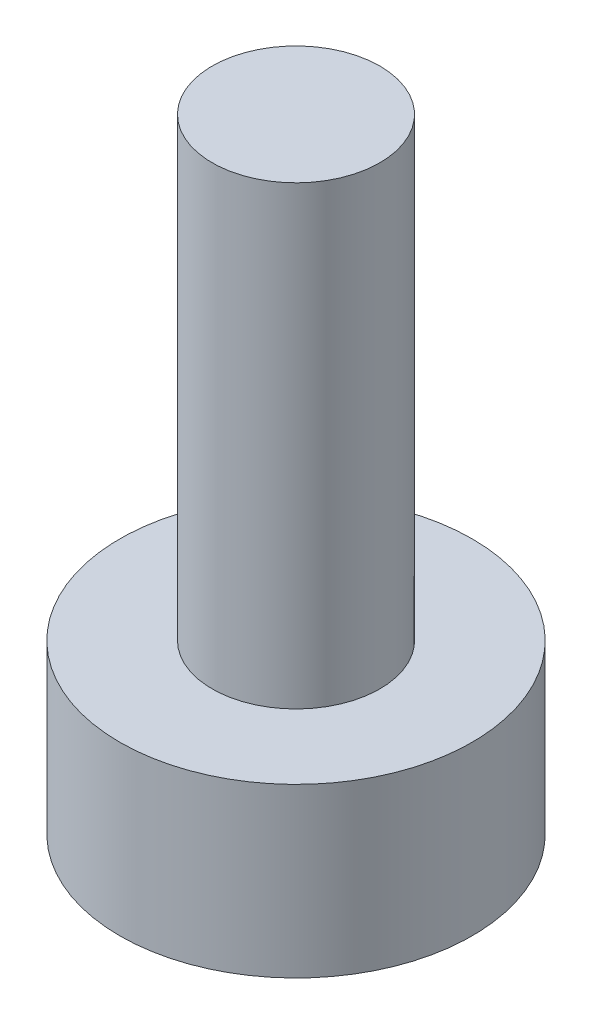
ISO-10303-21;
HEADER;
FILE_DESCRIPTION(('STEP AP214'),'2;1');
FILE_NAME('part.step','',(''),(''),'','','');
FILE_SCHEMA(('AUTOMOTIVE_DESIGN { 1 0 10303 214 1 1 1 1 }'));
ENDSEC;
DATA;
#1=APPLICATION_CONTEXT('core data for automotive mechanical design processes');
#2=APPLICATION_PROTOCOL_DEFINITION('international standard','automotive_design',2000,#1);
#3=PRODUCT_CONTEXT('',#1,'mechanical');
#4=PRODUCT('Part','Part','',(#3));
#5=PRODUCT_RELATED_PRODUCT_CATEGORY('part','',(#4));
#6=PRODUCT_DEFINITION_FORMATION('','',#4);
#7=PRODUCT_DEFINITION_CONTEXT('part definition',#1,'design');
#8=PRODUCT_DEFINITION('design','',#6,#7);
#9=PRODUCT_DEFINITION_SHAPE('','',#8);
#10=(LENGTH_UNIT() NAMED_UNIT(*) SI_UNIT(.MILLI.,.METRE.));
#11=(NAMED_UNIT(*) PLANE_ANGLE_UNIT() SI_UNIT($,.RADIAN.));
#12=(NAMED_UNIT(*) SI_UNIT($,.STERADIAN.) SOLID_ANGLE_UNIT());
#13=UNCERTAINTY_MEASURE_WITH_UNIT(LENGTH_MEASURE(1.E-05),#10,'distance_accuracy_value','');
#14=(GEOMETRIC_REPRESENTATION_CONTEXT(3) GLOBAL_UNCERTAINTY_ASSIGNED_CONTEXT((#13)) GLOBAL_UNIT_ASSIGNED_CONTEXT((#10,
#11,#12)) REPRESENTATION_CONTEXT('',''));
#15=CARTESIAN_POINT('',(0.,0.,0.));
#16=DIRECTION('',(0.,0.,1.));
#17=DIRECTION('',(1.,0.,0.));
#18=AXIS2_PLACEMENT_3D('',#15,#16,#17);
#19=CARTESIAN_POINT('',(0.,3.5052,0.));
#20=DIRECTION('',(0.,1.,0.));
#21=DIRECTION('',(0.,0.,1.));
#22=AXIS2_PLACEMENT_3D('',#19,#20,#21);
#23=PLANE('',#22);
#24=CARTESIAN_POINT('',(0.,3.5052,0.));
#25=DIRECTION('',(0.,1.,0.));
#26=DIRECTION('',(0.,0.,1.));
#27=AXIS2_PLACEMENT_3D('',#24,#25,#26);
#28=CIRCLE('',#27,3.683);
#29=CARTESIAN_POINT('',(0.,3.5052,3.683));
#30=VERTEX_POINT('',#29);
#31=EDGE_CURVE('E10',#30,#30,#28,.T.);
#32=ORIENTED_EDGE('',*,*,#31,.T.);
#33=EDGE_LOOP('',(#32));
#34=FACE_BOUND('',#33,.T.);
#35=CARTESIAN_POINT('',(0.,3.5052,0.));
#36=DIRECTION('',(0.,1.,0.));
#37=DIRECTION('',(0.,0.,1.));
#38=AXIS2_PLACEMENT_3D('',#35,#36,#37);
#39=CIRCLE('',#38,1.7526);
#40=CARTESIAN_POINT('',(0.,3.5052,-1.7526));
#41=VERTEX_POINT('',#40);
#42=EDGE_CURVE('E43',#41,#41,#39,.T.);
#43=ORIENTED_EDGE('',*,*,#42,.F.);
#44=EDGE_LOOP('',(#43));
#45=FACE_BOUND('',#44,.T.);
#46=ADVANCED_FACE('F28',(#34,#45),#23,.T.);
#47=CARTESIAN_POINT('',(0.,3.5052,0.));
#48=DIRECTION('',(0.,-1.,0.));
#49=DIRECTION('',(0.,0.,-1.));
#50=AXIS2_PLACEMENT_3D('',#47,#48,#49);
#51=CYLINDRICAL_SURFACE('',#50,3.683);
#52=ORIENTED_EDGE('',*,*,#31,.F.);
#53=EDGE_LOOP('',(#52));
#54=FACE_BOUND('',#53,.T.);
#55=CARTESIAN_POINT('',(0.,0.,0.));
#56=DIRECTION('',(0.,1.,0.));
#57=DIRECTION('',(0.,0.,1.));
#58=AXIS2_PLACEMENT_3D('',#55,#56,#57);
#59=CIRCLE('',#58,3.683);
#60=CARTESIAN_POINT('',(0.,0.,3.683));
#61=VERTEX_POINT('',#60);
#62=EDGE_CURVE('E35',#61,#61,#59,.T.);
#63=ORIENTED_EDGE('',*,*,#62,.T.);
#64=EDGE_LOOP('',(#63));
#65=FACE_BOUND('',#64,.T.);
#66=ADVANCED_FACE('F30',(#54,#65),#51,.T.);
#67=CARTESIAN_POINT('',(0.,0.,0.));
#68=DIRECTION('',(0.,1.,0.));
#69=DIRECTION('',(0.,0.,1.));
#70=AXIS2_PLACEMENT_3D('',#67,#68,#69);
#71=PLANE('',#70);
#72=ORIENTED_EDGE('',*,*,#62,.F.);
#73=EDGE_LOOP('',(#72));
#74=FACE_BOUND('',#73,.T.);
#75=ADVANCED_FACE('F55',(#74),#71,.F.);
#76=CARTESIAN_POINT('',(0.,13.0302,0.));
#77=DIRECTION('',(0.,-1.,0.));
#78=DIRECTION('',(0.,0.,-1.));
#79=AXIS2_PLACEMENT_3D('',#76,#77,#78);
#80=CYLINDRICAL_SURFACE('',#79,1.7526);
#81=CARTESIAN_POINT('',(0.,13.0302,0.));
#82=DIRECTION('',(0.,1.,0.));
#83=DIRECTION('',(0.,0.,1.));
#84=AXIS2_PLACEMENT_3D('',#81,#82,#83);
#85=CIRCLE('',#84,1.7526);
#86=CARTESIAN_POINT('',(0.,13.0302,-1.7526));
#87=VERTEX_POINT('',#86);
#88=EDGE_CURVE('E39',#87,#87,#85,.T.);
#89=CARTESIAN_POINT('',(0.,13.0302,-1.7526));
#90=CARTESIAN_POINT('',(0.,12.93098125,-1.7526));
#91=CARTESIAN_POINT('',(0.,12.8317625,-1.7526));
#92=CARTESIAN_POINT('',(0.,12.633325,-1.7526));
#93=CARTESIAN_POINT('',(0.,12.53410625,-1.7526));
#94=CARTESIAN_POINT('',(0.,12.33566875,-1.7526));
#95=CARTESIAN_POINT('',(0.,12.23645,-1.7526));
#96=CARTESIAN_POINT('',(0.,12.0380125,-1.7526));
#97=CARTESIAN_POINT('',(0.,11.93879375,-1.7526));
#98=CARTESIAN_POINT('',(0.,11.74035625,-1.7526));
#99=CARTESIAN_POINT('',(0.,11.6411375,-1.7526));
#100=CARTESIAN_POINT('',(0.,11.4427,-1.7526));
#101=CARTESIAN_POINT('',(0.,11.34348125,-1.7526));
#102=CARTESIAN_POINT('',(0.,11.14504375,-1.7526));
#103=CARTESIAN_POINT('',(0.,11.045825,-1.7526));
#104=CARTESIAN_POINT('',(0.,10.8473875,-1.7526));
#105=CARTESIAN_POINT('',(0.,10.74816875,-1.7526));
#106=CARTESIAN_POINT('',(0.,10.54973125,-1.7526));
#107=CARTESIAN_POINT('',(0.,10.4505125,-1.7526));
#108=CARTESIAN_POINT('',(0.,10.252075,-1.7526));
#109=CARTESIAN_POINT('',(0.,10.15285625,-1.7526));
#110=CARTESIAN_POINT('',(0.,9.95441875,-1.7526));
#111=CARTESIAN_POINT('',(0.,9.8552,-1.7526));
#112=CARTESIAN_POINT('',(0.,9.6567625,-1.7526));
#113=CARTESIAN_POINT('',(0.,9.55754375,-1.7526));
#114=CARTESIAN_POINT('',(0.,9.35910625,-1.7526));
#115=CARTESIAN_POINT('',(0.,9.2598875,-1.7526));
#116=CARTESIAN_POINT('',(0.,9.06145,-1.7526));
#117=CARTESIAN_POINT('',(0.,8.96223125,-1.7526));
#118=CARTESIAN_POINT('',(0.,8.76379375,-1.7526));
#119=CARTESIAN_POINT('',(0.,8.664575,-1.7526));
#120=CARTESIAN_POINT('',(0.,8.4661375,-1.7526));
#121=CARTESIAN_POINT('',(0.,8.36691875,-1.7526));
#122=CARTESIAN_POINT('',(0.,8.16848125,-1.7526));
#123=CARTESIAN_POINT('',(0.,8.0692625,-1.7526));
#124=CARTESIAN_POINT('',(0.,7.870825,-1.7526));
#125=CARTESIAN_POINT('',(0.,7.77160625,-1.7526));
#126=CARTESIAN_POINT('',(0.,7.57316875,-1.7526));
#127=CARTESIAN_POINT('',(0.,7.47395,-1.7526));
#128=CARTESIAN_POINT('',(0.,7.2755125,-1.7526));
#129=CARTESIAN_POINT('',(0.,7.17629375,-1.7526));
#130=CARTESIAN_POINT('',(0.,6.97785625,-1.7526));
#131=CARTESIAN_POINT('',(0.,6.8786375,-1.7526));
#132=CARTESIAN_POINT('',(0.,6.6802,-1.7526));
#133=CARTESIAN_POINT('',(0.,6.58098125,-1.7526));
#134=CARTESIAN_POINT('',(0.,6.38254375,-1.7526));
#135=CARTESIAN_POINT('',(0.,6.283325,-1.7526));
#136=CARTESIAN_POINT('',(0.,6.0848875,-1.7526));
#137=CARTESIAN_POINT('',(0.,5.98566875,-1.7526));
#138=CARTESIAN_POINT('',(0.,5.78723125,-1.7526));
#139=CARTESIAN_POINT('',(0.,5.6880125,-1.7526));
#140=CARTESIAN_POINT('',(0.,5.489575,-1.7526));
#141=CARTESIAN_POINT('',(0.,5.39035625,-1.7526));
#142=CARTESIAN_POINT('',(0.,5.19191875,-1.7526));
#143=CARTESIAN_POINT('',(0.,5.0927,-1.7526));
#144=CARTESIAN_POINT('',(0.,4.8942625,-1.7526));
#145=CARTESIAN_POINT('',(0.,4.79504375,-1.7526));
#146=CARTESIAN_POINT('',(0.,4.59660625,-1.7526));
#147=CARTESIAN_POINT('',(0.,4.4973875,-1.7526));
#148=CARTESIAN_POINT('',(0.,4.29895,-1.7526));
#149=CARTESIAN_POINT('',(0.,4.19973125,-1.7526));
#150=CARTESIAN_POINT('',(0.,4.00129375,-1.7526));
#151=CARTESIAN_POINT('',(0.,3.902075,-1.7526));
#152=CARTESIAN_POINT('',(0.,3.7036375,-1.7526));
#153=CARTESIAN_POINT('',(0.,3.60441875,-1.7526));
#154=CARTESIAN_POINT('',(0.,3.5052,-1.7526));
#155=B_SPLINE_CURVE_WITH_KNOTS('',3,(#89,#90,#91,#92,#93,#94,#95,#96,#97,#98,#99,#100,#101,#102,
#103,#104,#105,#106,#107,#108,#109,#110,#111,#112,#113,#114,#115,#116,#117,#118,#119,#120,#121,
#122,#123,#124,#125,#126,#127,#128,#129,#130,#131,#132,#133,#134,#135,#136,#137,#138,#139,#140,
#141,#142,#143,#144,#145,#146,#147,#148,#149,#150,#151,#152,#153,#154),.UNSPECIFIED.,.F.,.F.,(4,
2,2,2,2,2,2,2,2,2,2,2,2,2,2,2,2,2,2,2,2,2,2,2,2,2,2,2,2,2,2,2,4),(0.,0.29765625,0.5953125,
0.892968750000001,1.190625,1.48828125,1.7859375,2.08359375,2.38125,2.67890625,2.9765625,
3.27421875,3.571875,3.86953125,4.1671875,4.46484375,4.7625,5.06015625,5.3578125,5.65546875,
5.953125,6.25078125,6.5484375,6.84609375,7.14375,7.44140625,7.7390625,8.03671875,8.334375,
8.63203125,8.9296875,9.22734375,9.525),.UNSPECIFIED.);
#156=EDGE_CURVE('BSEAM49',#87,#41,#155,.T.);
#157=ORIENTED_EDGE('',*,*,#88,.F.);
#158=ORIENTED_EDGE('',*,*,#42,.T.);
#159=ORIENTED_EDGE('',*,*,#156,.T.);
#160=ORIENTED_EDGE('',*,*,#156,.F.);
#161=EDGE_LOOP('',(#157,#159,#158,#160));
#162=FACE_BOUND('',#161,.T.);
#163=ADVANCED_FACE('F49',(#162),#80,.T.);
#164=CARTESIAN_POINT('',(0.,13.0302,0.));
#165=DIRECTION('',(0.,1.,0.));
#166=DIRECTION('',(0.,0.,1.));
#167=AXIS2_PLACEMENT_3D('',#164,#165,#166);
#168=PLANE('',#167);
#169=ORIENTED_EDGE('',*,*,#88,.T.);
#170=EDGE_LOOP('',(#169));
#171=FACE_BOUND('',#170,.T.);
#172=ADVANCED_FACE('F63',(#171),#168,.T.);
#173=CLOSED_SHELL('',(#46,#66,#75,#163,#172));
#174=MANIFOLD_SOLID_BREP('B2',#173);
#175=ADVANCED_BREP_SHAPE_REPRESENTATION('',(#18,#174),#14);
#176=SHAPE_DEFINITION_REPRESENTATION(#9,#175);
ENDSEC;
END-ISO-10303-21;
